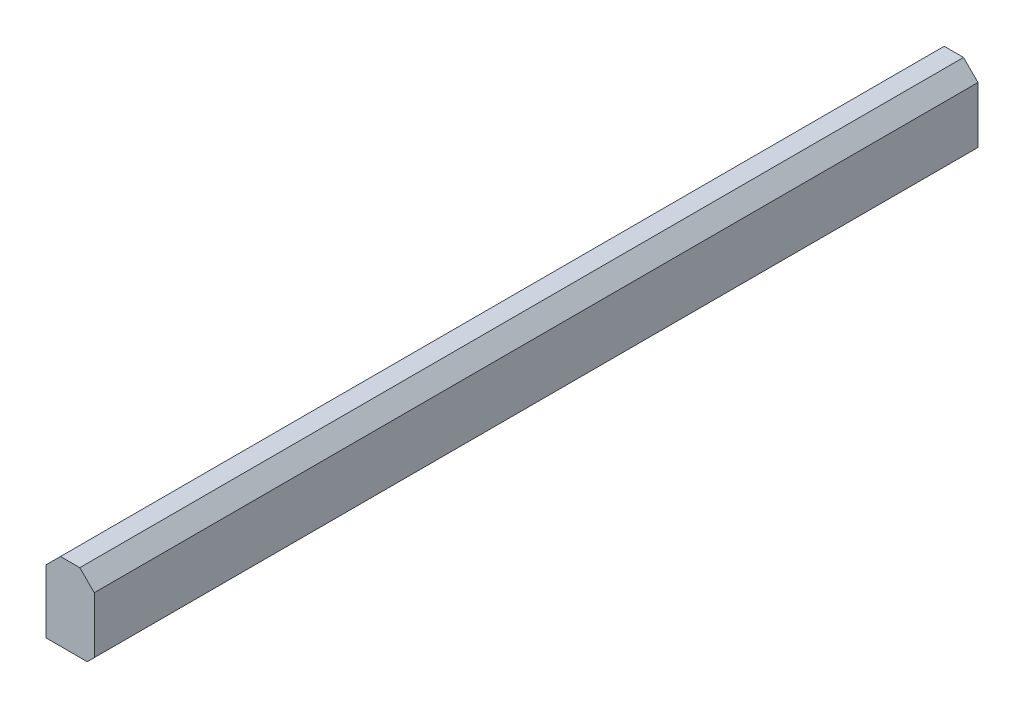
ISO-10303-21;
HEADER;
FILE_DESCRIPTION(('STEP AP214'),'2;1');
FILE_NAME('part.step','',(''),(''),'','','');
FILE_SCHEMA(('AUTOMOTIVE_DESIGN { 1 0 10303 214 1 1 1 1 }'));
ENDSEC;
DATA;
#1=APPLICATION_CONTEXT('core data for automotive mechanical design processes');
#2=APPLICATION_PROTOCOL_DEFINITION('international standard','automotive_design',2000,#1);
#3=PRODUCT_CONTEXT('',#1,'mechanical');
#4=PRODUCT('Part','Part','',(#3));
#5=PRODUCT_RELATED_PRODUCT_CATEGORY('part','',(#4));
#6=PRODUCT_DEFINITION_FORMATION('','',#4);
#7=PRODUCT_DEFINITION_CONTEXT('part definition',#1,'design');
#8=PRODUCT_DEFINITION('design','',#6,#7);
#9=PRODUCT_DEFINITION_SHAPE('','',#8);
#10=(LENGTH_UNIT() NAMED_UNIT(*) SI_UNIT(.MILLI.,.METRE.));
#11=(NAMED_UNIT(*) PLANE_ANGLE_UNIT() SI_UNIT($,.RADIAN.));
#12=(NAMED_UNIT(*) SI_UNIT($,.STERADIAN.) SOLID_ANGLE_UNIT());
#13=UNCERTAINTY_MEASURE_WITH_UNIT(LENGTH_MEASURE(1.E-05),#10,'distance_accuracy_value','');
#14=(GEOMETRIC_REPRESENTATION_CONTEXT(3) GLOBAL_UNCERTAINTY_ASSIGNED_CONTEXT((#13)) GLOBAL_UNIT_ASSIGNED_CONTEXT((#10,
#11,#12)) REPRESENTATION_CONTEXT('',''));
#15=CARTESIAN_POINT('',(0.,0.,0.));
#16=DIRECTION('',(0.,0.,1.));
#17=DIRECTION('',(1.,0.,0.));
#18=AXIS2_PLACEMENT_3D('',#15,#16,#17);
#19=CARTESIAN_POINT('',(-58.42,94.107,1069.69647766));
#20=DIRECTION('',(0.,-1.,0.));
#21=DIRECTION('',(1.,0.,0.));
#22=AXIS2_PLACEMENT_3D('',#19,#20,#21);
#23=PLANE('',#22);
#24=DIRECTION('',(-1.,0.,0.));
#25=VECTOR('',#24,1.);
#26=CARTESIAN_POINT('',(-58.42,94.107,-1069.69647766));
#27=LINE('',#26,#25);
#28=CARTESIAN_POINT('',(23.4200000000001,94.107,-1069.69647766));
#29=VERTEX_POINT('',#28);
#30=CARTESIAN_POINT('',(-23.4200000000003,94.107,-1069.69647766));
#31=VERTEX_POINT('',#30);
#32=EDGE_CURVE('E141',#29,#31,#27,.T.);
#33=ORIENTED_EDGE('',*,*,#32,.T.);
#34=DIRECTION('',(0.,0.,1.));
#35=VECTOR('',#34,1.);
#36=CARTESIAN_POINT('',(-23.4200000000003,94.107,1069.69647766));
#37=LINE('',#36,#35);
#38=CARTESIAN_POINT('',(-23.4200000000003,94.107,1069.69647766));
#39=VERTEX_POINT('',#38);
#40=EDGE_CURVE('E68',#31,#39,#37,.T.);
#41=ORIENTED_EDGE('',*,*,#40,.T.);
#42=DIRECTION('',(-1.,0.,0.));
#43=VECTOR('',#42,1.);
#44=CARTESIAN_POINT('',(-58.42,94.107,1069.69647766));
#45=LINE('',#44,#43);
#46=CARTESIAN_POINT('',(23.4200000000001,94.107,1069.69647766));
#47=VERTEX_POINT('',#46);
#48=EDGE_CURVE('E116',#47,#39,#45,.T.);
#49=ORIENTED_EDGE('',*,*,#48,.F.);
#50=DIRECTION('',(0.,0.,-1.));
#51=VECTOR('',#50,1.);
#52=CARTESIAN_POINT('',(23.4200000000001,94.107,1069.69647766));
#53=LINE('',#52,#51);
#54=EDGE_CURVE('E175',#47,#29,#53,.T.);
#55=ORIENTED_EDGE('',*,*,#54,.T.);
#56=EDGE_LOOP('',(#33,#41,#49,#55));
#57=FACE_BOUND('',#56,.T.);
#58=ADVANCED_FACE('F46',(#57),#23,.F.);
#59=CARTESIAN_POINT('',(-58.42,-94.107,1069.69647766));
#60=DIRECTION('',(1.,0.,0.));
#61=DIRECTION('',(0.,0.,-1.));
#62=AXIS2_PLACEMENT_3D('',#59,#60,#61);
#63=PLANE('',#62);
#64=DIRECTION('',(0.,-1.,0.));
#65=VECTOR('',#64,1.);
#66=CARTESIAN_POINT('',(-58.42,-94.107,1069.69647766));
#67=LINE('',#66,#65);
#68=CARTESIAN_POINT('',(-58.42,59.1070000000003,1069.69647766));
#69=VERTEX_POINT('',#68);
#70=CARTESIAN_POINT('',(-58.42,-94.107,1069.69647766));
#71=VERTEX_POINT('',#70);
#72=EDGE_CURVE('E108',#69,#71,#67,.T.);
#73=ORIENTED_EDGE('',*,*,#72,.F.);
#74=DIRECTION('',(0.,0.,-1.));
#75=VECTOR('',#74,1.);
#76=CARTESIAN_POINT('',(-58.42,59.1070000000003,1069.69647766));
#77=LINE('',#76,#75);
#78=CARTESIAN_POINT('',(-58.42,59.1070000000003,-1069.69647766));
#79=VERTEX_POINT('',#78);
#80=EDGE_CURVE('E164',#69,#79,#77,.T.);
#81=ORIENTED_EDGE('',*,*,#80,.T.);
#82=DIRECTION('',(0.,-1.,0.));
#83=VECTOR('',#82,1.);
#84=CARTESIAN_POINT('',(-58.42,-94.107,-1069.69647766));
#85=LINE('',#84,#83);
#86=CARTESIAN_POINT('',(-58.42,-94.107,-1069.69647766));
#87=VERTEX_POINT('',#86);
#88=EDGE_CURVE('E127',#79,#87,#85,.T.);
#89=ORIENTED_EDGE('',*,*,#88,.T.);
#90=DIRECTION('',(0.,0.,-1.));
#91=VECTOR('',#90,1.);
#92=CARTESIAN_POINT('',(-58.42,-94.107,1069.69647766));
#93=LINE('',#92,#91);
#94=EDGE_CURVE('E124',#71,#87,#93,.T.);
#95=ORIENTED_EDGE('',*,*,#94,.F.);
#96=EDGE_LOOP('',(#73,#81,#89,#95));
#97=FACE_BOUND('',#96,.T.);
#98=ADVANCED_FACE('F123',(#97),#63,.F.);
#99=CARTESIAN_POINT('',(-58.42,-94.107,1069.69647766));
#100=DIRECTION('',(0.,1.,0.));
#101=DIRECTION('',(-1.,0.,0.));
#102=AXIS2_PLACEMENT_3D('',#99,#100,#101);
#103=PLANE('',#102);
#104=DIRECTION('',(1.,0.,0.));
#105=VECTOR('',#104,1.);
#106=CARTESIAN_POINT('',(-58.42,-94.107,-1069.69647766));
#107=LINE('',#106,#105);
#108=CARTESIAN_POINT('',(41.4200000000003,-94.107,-1069.69647766));
#109=VERTEX_POINT('',#108);
#110=EDGE_CURVE('E146',#87,#109,#107,.T.);
#111=ORIENTED_EDGE('',*,*,#110,.T.);
#112=DIRECTION('',(0.,0.,1.));
#113=VECTOR('',#112,1.);
#114=CARTESIAN_POINT('',(41.4200000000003,-94.107,1069.69647766));
#115=LINE('',#114,#113);
#116=CARTESIAN_POINT('',(41.4200000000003,-94.107,1069.69647766));
#117=VERTEX_POINT('',#116);
#118=EDGE_CURVE('E136',#109,#117,#115,.T.);
#119=ORIENTED_EDGE('',*,*,#118,.T.);
#120=DIRECTION('',(1.,0.,0.));
#121=VECTOR('',#120,1.);
#122=CARTESIAN_POINT('',(-58.42,-94.107,1069.69647766));
#123=LINE('',#122,#121);
#124=EDGE_CURVE('E114',#71,#117,#123,.T.);
#125=ORIENTED_EDGE('',*,*,#124,.F.);
#126=ORIENTED_EDGE('',*,*,#94,.T.);
#127=EDGE_LOOP('',(#111,#119,#125,#126));
#128=FACE_BOUND('',#127,.T.);
#129=ADVANCED_FACE('F135',(#128),#103,.F.);
#130=CARTESIAN_POINT('',(58.42,-94.107,1069.69647766));
#131=DIRECTION('',(-1.,0.,0.));
#132=DIRECTION('',(0.,0.,1.));
#133=AXIS2_PLACEMENT_3D('',#130,#131,#132);
#134=PLANE('',#133);
#135=DIRECTION('',(0.,1.,0.));
#136=VECTOR('',#135,1.);
#137=CARTESIAN_POINT('',(58.42,-94.107,-1069.69647766));
#138=LINE('',#137,#136);
#139=CARTESIAN_POINT('',(58.42,-77.1070000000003,-1069.69647766));
#140=VERTEX_POINT('',#139);
#141=CARTESIAN_POINT('',(58.42,59.1070000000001,-1069.69647766));
#142=VERTEX_POINT('',#141);
#143=EDGE_CURVE('E151',#140,#142,#138,.T.);
#144=ORIENTED_EDGE('',*,*,#143,.T.);
#145=DIRECTION('',(0.,0.,1.));
#146=VECTOR('',#145,1.);
#147=CARTESIAN_POINT('',(58.42,59.1070000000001,1069.69647766));
#148=LINE('',#147,#146);
#149=CARTESIAN_POINT('',(58.42,59.1070000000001,1069.69647766));
#150=VERTEX_POINT('',#149);
#151=EDGE_CURVE('E11',#142,#150,#148,.T.);
#152=ORIENTED_EDGE('',*,*,#151,.T.);
#153=DIRECTION('',(0.,1.,0.));
#154=VECTOR('',#153,1.);
#155=CARTESIAN_POINT('',(58.42,-94.107,1069.69647766));
#156=LINE('',#155,#154);
#157=CARTESIAN_POINT('',(58.42,-77.1070000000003,1069.69647766));
#158=VERTEX_POINT('',#157);
#159=EDGE_CURVE('E134',#158,#150,#156,.T.);
#160=ORIENTED_EDGE('',*,*,#159,.F.);
#161=DIRECTION('',(0.,0.,-1.));
#162=VECTOR('',#161,1.);
#163=CARTESIAN_POINT('',(58.42,-77.1070000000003,1069.69647766));
#164=LINE('',#163,#162);
#165=EDGE_CURVE('E133',#158,#140,#164,.T.);
#166=ORIENTED_EDGE('',*,*,#165,.T.);
#167=EDGE_LOOP('',(#144,#152,#160,#166));
#168=FACE_BOUND('',#167,.T.);
#169=ADVANCED_FACE('F191',(#168),#134,.F.);
#170=CARTESIAN_POINT('',(0.,0.,1069.69647766));
#171=DIRECTION('',(0.,0.,1.));
#172=DIRECTION('',(1.,0.,0.));
#173=AXIS2_PLACEMENT_3D('',#170,#171,#172);
#174=PLANE('',#173);
#175=ORIENTED_EDGE('',*,*,#48,.T.);
#176=DIRECTION('',(0.707106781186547,0.707106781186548,0.));
#177=VECTOR('',#176,1.);
#178=CARTESIAN_POINT('',(-58.7635000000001,58.7635000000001,1069.69647766));
#179=LINE('',#178,#177);
#180=EDGE_CURVE('E57',#39,#69,#179,.F.);
#181=ORIENTED_EDGE('',*,*,#180,.T.);
#182=ORIENTED_EDGE('',*,*,#72,.T.);
#183=ORIENTED_EDGE('',*,*,#124,.T.);
#184=DIRECTION('',(-0.707106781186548,-0.707106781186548,0.));
#185=VECTOR('',#184,1.);
#186=CARTESIAN_POINT('',(67.7635000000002,-67.7635000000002,1069.69647766));
#187=LINE('',#186,#185);
#188=EDGE_CURVE('E165',#117,#158,#187,.F.);
#189=ORIENTED_EDGE('',*,*,#188,.T.);
#190=ORIENTED_EDGE('',*,*,#159,.T.);
#191=DIRECTION('',(0.707106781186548,-0.707106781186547,0.));
#192=VECTOR('',#191,1.);
#193=CARTESIAN_POINT('',(58.7635,58.7635000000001,1069.69647766));
#194=LINE('',#193,#192);
#195=EDGE_CURVE('E180',#150,#47,#194,.F.);
#196=ORIENTED_EDGE('',*,*,#195,.T.);
#197=EDGE_LOOP('',(#175,#181,#182,#183,#189,#190,#196));
#198=FACE_BOUND('',#197,.T.);
#199=ADVANCED_FACE('F112',(#198),#174,.T.);
#200=CARTESIAN_POINT('',(0.,0.,-1069.69647766));
#201=DIRECTION('',(0.,0.,1.));
#202=DIRECTION('',(1.,0.,0.));
#203=AXIS2_PLACEMENT_3D('',#200,#201,#202);
#204=PLANE('',#203);
#205=ORIENTED_EDGE('',*,*,#88,.F.);
#206=DIRECTION('',(-0.707106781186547,-0.707106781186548,0.));
#207=VECTOR('',#206,1.);
#208=CARTESIAN_POINT('',(-58.42,59.1070000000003,-1069.69647766));
#209=LINE('',#208,#207);
#210=EDGE_CURVE('E173',#79,#31,#209,.F.);
#211=ORIENTED_EDGE('',*,*,#210,.T.);
#212=ORIENTED_EDGE('',*,*,#32,.F.);
#213=DIRECTION('',(-0.707106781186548,0.707106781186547,0.));
#214=VECTOR('',#213,1.);
#215=CARTESIAN_POINT('',(23.4200000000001,94.107,-1069.69647766));
#216=LINE('',#215,#214);
#217=EDGE_CURVE('E169',#29,#142,#216,.F.);
#218=ORIENTED_EDGE('',*,*,#217,.T.);
#219=ORIENTED_EDGE('',*,*,#143,.F.);
#220=DIRECTION('',(0.707106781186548,0.707106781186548,0.));
#221=VECTOR('',#220,1.);
#222=CARTESIAN_POINT('',(58.42,-77.1070000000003,-1069.69647766));
#223=LINE('',#222,#221);
#224=EDGE_CURVE('E160',#140,#109,#223,.F.);
#225=ORIENTED_EDGE('',*,*,#224,.T.);
#226=ORIENTED_EDGE('',*,*,#110,.F.);
#227=EDGE_LOOP('',(#205,#211,#212,#218,#219,#225,#226));
#228=FACE_BOUND('',#227,.T.);
#229=ADVANCED_FACE('F186',(#228),#204,.F.);
#230=CARTESIAN_POINT('',(58.42,-77.1070000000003,1069.69647766));
#231=DIRECTION('',(-0.707106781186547,0.707106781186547,0.));
#232=DIRECTION('',(0.,0.,-1.));
#233=AXIS2_PLACEMENT_3D('',#230,#231,#232);
#234=PLANE('',#233);
#235=ORIENTED_EDGE('',*,*,#188,.F.);
#236=ORIENTED_EDGE('',*,*,#118,.F.);
#237=ORIENTED_EDGE('',*,*,#224,.F.);
#238=ORIENTED_EDGE('',*,*,#165,.F.);
#239=EDGE_LOOP('',(#235,#236,#237,#238));
#240=FACE_BOUND('',#239,.T.);
#241=ADVANCED_FACE('F193',(#240),#234,.F.);
#242=CARTESIAN_POINT('',(-58.42,59.1070000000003,1069.69647766));
#243=DIRECTION('',(0.707106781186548,-0.707106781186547,0.));
#244=DIRECTION('',(0.,0.,-1.));
#245=AXIS2_PLACEMENT_3D('',#242,#243,#244);
#246=PLANE('',#245);
#247=ORIENTED_EDGE('',*,*,#180,.F.);
#248=ORIENTED_EDGE('',*,*,#40,.F.);
#249=ORIENTED_EDGE('',*,*,#210,.F.);
#250=ORIENTED_EDGE('',*,*,#80,.F.);
#251=EDGE_LOOP('',(#247,#248,#249,#250));
#252=FACE_BOUND('',#251,.T.);
#253=ADVANCED_FACE('F198',(#252),#246,.F.);
#254=CARTESIAN_POINT('',(23.4200000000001,94.107,1069.69647766));
#255=DIRECTION('',(-0.707106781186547,-0.707106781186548,0.));
#256=DIRECTION('',(0.,0.,-1.));
#257=AXIS2_PLACEMENT_3D('',#254,#255,#256);
#258=PLANE('',#257);
#259=ORIENTED_EDGE('',*,*,#195,.F.);
#260=ORIENTED_EDGE('',*,*,#151,.F.);
#261=ORIENTED_EDGE('',*,*,#217,.F.);
#262=ORIENTED_EDGE('',*,*,#54,.F.);
#263=EDGE_LOOP('',(#259,#260,#261,#262));
#264=FACE_BOUND('',#263,.T.);
#265=ADVANCED_FACE('F47',(#264),#258,.F.);
#266=CLOSED_SHELL('',(#58,#98,#129,#169,#199,#229,#241,#253,#265));
#267=MANIFOLD_SOLID_BREP('B2',#266);
#268=ADVANCED_BREP_SHAPE_REPRESENTATION('',(#18,#267),#14);
#269=SHAPE_DEFINITION_REPRESENTATION(#9,#268);
ENDSEC;
END-ISO-10303-21;
